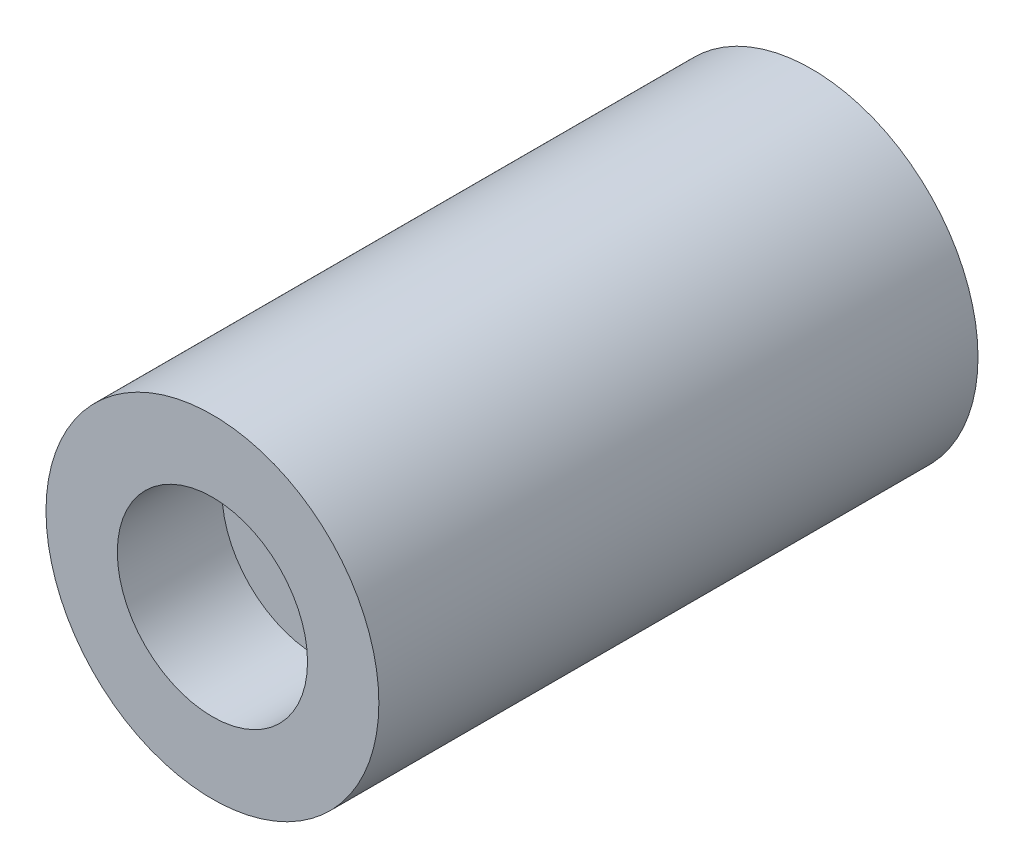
ISO-10303-21;
HEADER;
FILE_DESCRIPTION(('STEP AP214'),'2;1');
FILE_NAME('part.step','',(''),(''),'','','');
FILE_SCHEMA(('AUTOMOTIVE_DESIGN { 1 0 10303 214 1 1 1 1 }'));
ENDSEC;
DATA;
#1=APPLICATION_CONTEXT('core data for automotive mechanical design processes');
#2=APPLICATION_PROTOCOL_DEFINITION('international standard','automotive_design',2000,#1);
#3=PRODUCT_CONTEXT('',#1,'mechanical');
#4=PRODUCT('Part','Part','',(#3));
#5=PRODUCT_RELATED_PRODUCT_CATEGORY('part','',(#4));
#6=PRODUCT_DEFINITION_FORMATION('','',#4);
#7=PRODUCT_DEFINITION_CONTEXT('part definition',#1,'design');
#8=PRODUCT_DEFINITION('design','',#6,#7);
#9=PRODUCT_DEFINITION_SHAPE('','',#8);
#10=(LENGTH_UNIT() NAMED_UNIT(*) SI_UNIT(.MILLI.,.METRE.));
#11=(NAMED_UNIT(*) PLANE_ANGLE_UNIT() SI_UNIT($,.RADIAN.));
#12=(NAMED_UNIT(*) SI_UNIT($,.STERADIAN.) SOLID_ANGLE_UNIT());
#13=UNCERTAINTY_MEASURE_WITH_UNIT(LENGTH_MEASURE(1.E-05),#10,'distance_accuracy_value','');
#14=(GEOMETRIC_REPRESENTATION_CONTEXT(3) GLOBAL_UNCERTAINTY_ASSIGNED_CONTEXT((#13)) GLOBAL_UNIT_ASSIGNED_CONTEXT((#10,
#11,#12)) REPRESENTATION_CONTEXT('',''));
#15=CARTESIAN_POINT('',(0.,0.,0.));
#16=DIRECTION('',(0.,0.,1.));
#17=DIRECTION('',(1.,0.,0.));
#18=AXIS2_PLACEMENT_3D('',#15,#16,#17);
#19=CARTESIAN_POINT('',(0.,0.,63.));
#20=DIRECTION('',(0.,0.,1.));
#21=DIRECTION('',(1.,0.,0.));
#22=AXIS2_PLACEMENT_3D('',#19,#20,#21);
#23=PLANE('',#22);
#24=CARTESIAN_POINT('',(0.,0.,63.));
#25=DIRECTION('',(0.,0.,1.));
#26=DIRECTION('',(1.,0.,0.));
#27=AXIS2_PLACEMENT_3D('',#24,#25,#26);
#28=CIRCLE('',#27,17.5);
#29=CARTESIAN_POINT('',(17.5,0.,63.));
#30=VERTEX_POINT('',#29);
#31=EDGE_CURVE('E8',#30,#30,#28,.T.);
#32=ORIENTED_EDGE('',*,*,#31,.T.);
#33=EDGE_LOOP('',(#32));
#34=FACE_BOUND('',#33,.T.);
#35=CARTESIAN_POINT('',(0.,0.,63.));
#36=DIRECTION('',(0.,0.,1.));
#37=DIRECTION('',(1.,0.,0.));
#38=AXIS2_PLACEMENT_3D('',#35,#36,#37);
#39=CIRCLE('',#38,10.);
#40=CARTESIAN_POINT('',(10.,0.,63.));
#41=VERTEX_POINT('',#40);
#42=EDGE_CURVE('E26',#41,#41,#39,.T.);
#43=ORIENTED_EDGE('',*,*,#42,.F.);
#44=EDGE_LOOP('',(#43));
#45=FACE_BOUND('',#44,.T.);
#46=ADVANCED_FACE('F12',(#34,#45),#23,.T.);
#47=CARTESIAN_POINT('',(0.,0.,0.));
#48=DIRECTION('',(0.,0.,1.));
#49=DIRECTION('',(1.,0.,0.));
#50=AXIS2_PLACEMENT_3D('',#47,#48,#49);
#51=PLANE('',#50);
#52=CARTESIAN_POINT('',(0.,0.,0.));
#53=DIRECTION('',(0.,0.,1.));
#54=DIRECTION('',(1.,0.,0.));
#55=AXIS2_PLACEMENT_3D('',#52,#53,#54);
#56=CIRCLE('',#55,17.5);
#57=CARTESIAN_POINT('',(17.5,0.,0.));
#58=VERTEX_POINT('',#57);
#59=EDGE_CURVE('E20',#58,#58,#56,.T.);
#60=ORIENTED_EDGE('',*,*,#59,.F.);
#61=EDGE_LOOP('',(#60));
#62=FACE_BOUND('',#61,.T.);
#63=CARTESIAN_POINT('',(0.,0.,0.));
#64=DIRECTION('',(0.,0.,1.));
#65=DIRECTION('',(1.,0.,0.));
#66=AXIS2_PLACEMENT_3D('',#63,#64,#65);
#67=CIRCLE('',#66,4.5);
#68=CARTESIAN_POINT('',(4.5,0.,0.));
#69=VERTEX_POINT('',#68);
#70=EDGE_CURVE('E16',#69,#69,#67,.F.);
#71=ORIENTED_EDGE('',*,*,#70,.F.);
#72=EDGE_LOOP('',(#71));
#73=FACE_BOUND('',#72,.T.);
#74=ADVANCED_FACE('F53',(#62,#73),#51,.F.);
#75=CARTESIAN_POINT('',(0.,0.,63.));
#76=DIRECTION('',(0.,0.,-1.));
#77=DIRECTION('',(-1.,0.,0.));
#78=AXIS2_PLACEMENT_3D('',#75,#76,#77);
#79=CYLINDRICAL_SURFACE('',#78,17.5);
#80=ORIENTED_EDGE('',*,*,#31,.F.);
#81=EDGE_LOOP('',(#80));
#82=FACE_BOUND('',#81,.T.);
#83=ORIENTED_EDGE('',*,*,#59,.T.);
#84=EDGE_LOOP('',(#83));
#85=FACE_BOUND('',#84,.T.);
#86=ADVANCED_FACE('F14',(#82,#85),#79,.T.);
#87=CARTESIAN_POINT('',(0.,0.,63.));
#88=DIRECTION('',(0.,0.,1.));
#89=DIRECTION('',(1.,0.,0.));
#90=AXIS2_PLACEMENT_3D('',#87,#88,#89);
#91=CYLINDRICAL_SURFACE('',#90,4.5);
#92=CARTESIAN_POINT('',(0.,0.,52.));
#93=DIRECTION('',(0.,0.,1.));
#94=DIRECTION('',(1.,0.,0.));
#95=AXIS2_PLACEMENT_3D('',#92,#93,#94);
#96=CIRCLE('',#95,4.5);
#97=CARTESIAN_POINT('',(4.5,0.,52.));
#98=VERTEX_POINT('',#97);
#99=EDGE_CURVE('E32',#98,#98,#96,.T.);
#100=ORIENTED_EDGE('',*,*,#99,.T.);
#101=EDGE_LOOP('',(#100));
#102=FACE_BOUND('',#101,.T.);
#103=ORIENTED_EDGE('',*,*,#70,.T.);
#104=EDGE_LOOP('',(#103));
#105=FACE_BOUND('',#104,.T.);
#106=ADVANCED_FACE('F36',(#102,#105),#91,.F.);
#107=CARTESIAN_POINT('',(0.,0.,63.));
#108=DIRECTION('',(0.,0.,1.));
#109=DIRECTION('',(1.,0.,0.));
#110=AXIS2_PLACEMENT_3D('',#107,#108,#109);
#111=CYLINDRICAL_SURFACE('',#110,10.);
#112=ORIENTED_EDGE('',*,*,#42,.T.);
#113=EDGE_LOOP('',(#112));
#114=FACE_BOUND('',#113,.T.);
#115=CARTESIAN_POINT('',(0.,0.,52.));
#116=DIRECTION('',(0.,0.,1.));
#117=DIRECTION('',(1.,0.,0.));
#118=AXIS2_PLACEMENT_3D('',#115,#116,#117);
#119=CIRCLE('',#118,10.);
#120=CARTESIAN_POINT('',(10.,0.,52.));
#121=VERTEX_POINT('',#120);
#122=EDGE_CURVE('E29',#121,#121,#119,.T.);
#123=ORIENTED_EDGE('',*,*,#122,.F.);
#124=EDGE_LOOP('',(#123));
#125=FACE_BOUND('',#124,.T.);
#126=ADVANCED_FACE('F41',(#114,#125),#111,.F.);
#127=CARTESIAN_POINT('',(4.5,0.,52.));
#128=DIRECTION('',(0.,0.,1.));
#129=DIRECTION('',(1.,0.,0.));
#130=AXIS2_PLACEMENT_3D('',#127,#128,#129);
#131=PLANE('',#130);
#132=ORIENTED_EDGE('',*,*,#122,.T.);
#133=EDGE_LOOP('',(#132));
#134=FACE_BOUND('',#133,.T.);
#135=ORIENTED_EDGE('',*,*,#99,.F.);
#136=EDGE_LOOP('',(#135));
#137=FACE_BOUND('',#136,.T.);
#138=ADVANCED_FACE('F39',(#134,#137),#131,.T.);
#139=CLOSED_SHELL('',(#46,#74,#86,#106,#126,#138));
#140=MANIFOLD_SOLID_BREP('B1',#139);
#141=ADVANCED_BREP_SHAPE_REPRESENTATION('',(#18,#140),#14);
#142=SHAPE_DEFINITION_REPRESENTATION(#9,#141);
ENDSEC;
END-ISO-10303-21;
